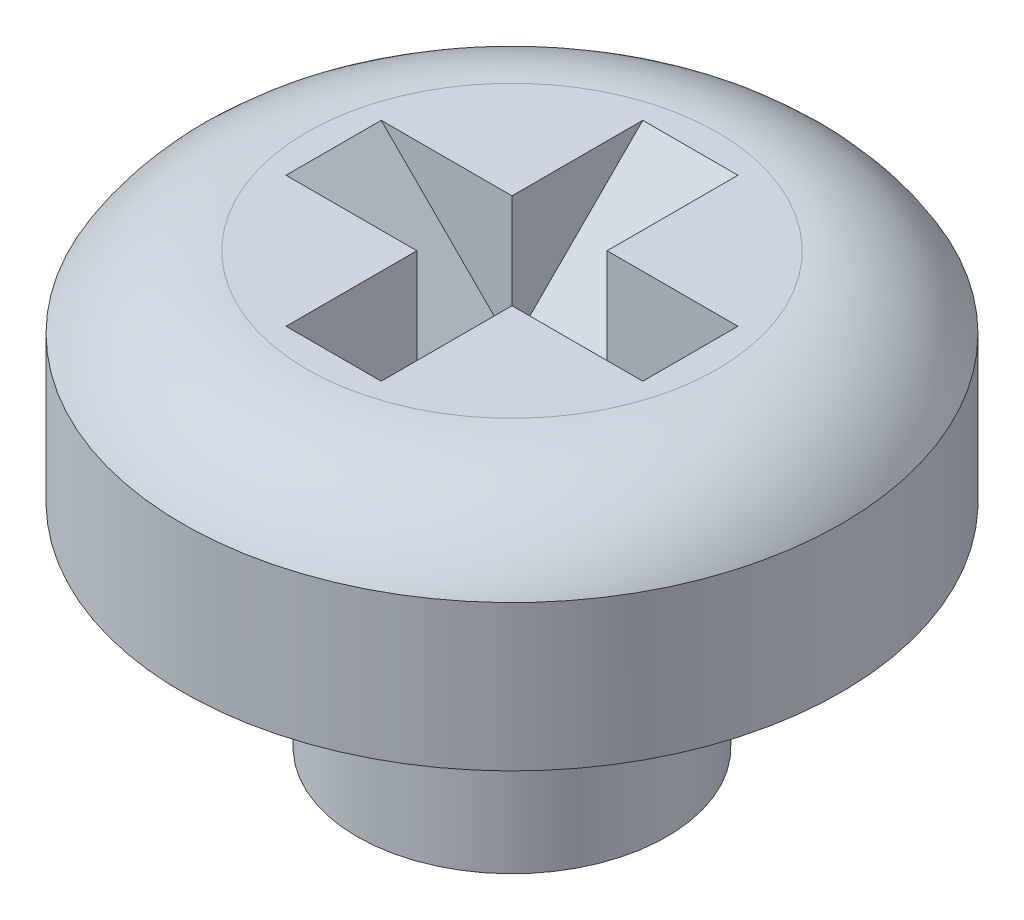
ISO-10303-21;
HEADER;
FILE_DESCRIPTION(('STEP AP214'),'2;1');
FILE_NAME('part.step','',(''),(''),'','','');
FILE_SCHEMA(('AUTOMOTIVE_DESIGN { 1 0 10303 214 1 1 1 1 }'));
ENDSEC;
DATA;
#1=APPLICATION_CONTEXT('core data for automotive mechanical design processes');
#2=APPLICATION_PROTOCOL_DEFINITION('international standard','automotive_design',2000,#1);
#3=PRODUCT_CONTEXT('',#1,'mechanical');
#4=PRODUCT('Part','Part','',(#3));
#5=PRODUCT_RELATED_PRODUCT_CATEGORY('part','',(#4));
#6=PRODUCT_DEFINITION_FORMATION('','',#4);
#7=PRODUCT_DEFINITION_CONTEXT('part definition',#1,'design');
#8=PRODUCT_DEFINITION('design','',#6,#7);
#9=PRODUCT_DEFINITION_SHAPE('','',#8);
#10=(LENGTH_UNIT() NAMED_UNIT(*) SI_UNIT(.MILLI.,.METRE.));
#11=(NAMED_UNIT(*) PLANE_ANGLE_UNIT() SI_UNIT($,.RADIAN.));
#12=(NAMED_UNIT(*) SI_UNIT($,.STERADIAN.) SOLID_ANGLE_UNIT());
#13=UNCERTAINTY_MEASURE_WITH_UNIT(LENGTH_MEASURE(1.E-05),#10,'distance_accuracy_value','');
#14=(GEOMETRIC_REPRESENTATION_CONTEXT(3) GLOBAL_UNCERTAINTY_ASSIGNED_CONTEXT((#13)) GLOBAL_UNIT_ASSIGNED_CONTEXT((#10,
#11,#12)) REPRESENTATION_CONTEXT('',''));
#15=CARTESIAN_POINT('',(0.,0.,0.));
#16=DIRECTION('',(0.,0.,1.));
#17=DIRECTION('',(1.,0.,0.));
#18=AXIS2_PLACEMENT_3D('',#15,#16,#17);
#19=CARTESIAN_POINT('',(0.695421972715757,148.957072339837,-2.77018749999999));
#20=DIRECTION('',(0.,0.707106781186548,0.70710678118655));
#21=DIRECTION('',(0.,-0.707106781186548,0.707106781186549));
#22=AXIS2_PLACEMENT_3D('',#19,#20,#21);
#23=PLANE('',#22);
#24=DIRECTION('',(1.00000000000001,0.,0.));
#25=VECTOR('',#24,1.);
#26=CARTESIAN_POINT('',(0.695421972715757,148.957072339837,-2.77018749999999));
#27=LINE('',#26,#25);
#28=CARTESIAN_POINT('',(1.43413863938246,148.957072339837,-2.77018750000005));
#29=VERTEX_POINT('',#28);
#30=CARTESIAN_POINT('',(-0.0432946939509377,148.957072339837,-2.77018749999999));
#31=VERTEX_POINT('',#30);
#32=EDGE_CURVE('E269',#29,#31,#27,.F.);
#33=ORIENTED_EDGE('',*,*,#32,.T.);
#34=DIRECTION('',(0.,0.707106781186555,-0.707106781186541));
#35=VECTOR('',#34,1.);
#36=CARTESIAN_POINT('',(-0.043294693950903,146.925601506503,-0.738716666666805));
#37=LINE('',#36,#35);
#38=CARTESIAN_POINT('',(-0.0432946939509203,146.925601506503,-0.738716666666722));
#39=VERTEX_POINT('',#38);
#40=EDGE_CURVE('E140',#39,#31,#37,.T.);
#41=ORIENTED_EDGE('',*,*,#40,.F.);
#42=DIRECTION('',(0.577350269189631,-0.577350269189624,0.577350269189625));
#43=VECTOR('',#42,1.);
#44=CARTESIAN_POINT('',(0.695421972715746,146.186884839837,0.));
#45=LINE('',#44,#43);
#46=CARTESIAN_POINT('',(0.695421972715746,146.186884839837,0.));
#47=VERTEX_POINT('',#46);
#48=EDGE_CURVE('E43',#39,#47,#45,.T.);
#49=ORIENTED_EDGE('',*,*,#48,.T.);
#50=DIRECTION('',(-0.577350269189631,-0.577350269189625,0.577350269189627));
#51=VECTOR('',#50,1.);
#52=CARTESIAN_POINT('',(2.54221363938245,148.033676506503,-1.8467916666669));
#53=LINE('',#52,#51);
#54=CARTESIAN_POINT('',(1.43413863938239,146.925601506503,-0.738716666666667));
#55=VERTEX_POINT('',#54);
#56=EDGE_CURVE('E11',#55,#47,#53,.T.);
#57=ORIENTED_EDGE('',*,*,#56,.F.);
#58=DIRECTION('',(0.,-0.707106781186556,0.707106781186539));
#59=VECTOR('',#58,1.);
#60=CARTESIAN_POINT('',(1.43413863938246,148.957072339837,-2.77018750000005));
#61=LINE('',#60,#59);
#62=EDGE_CURVE('E131',#29,#55,#61,.T.);
#63=ORIENTED_EDGE('',*,*,#62,.F.);
#64=EDGE_LOOP('',(#33,#41,#49,#57,#63));
#65=FACE_BOUND('',#64,.T.);
#66=ADVANCED_FACE('F34',(#65),#23,.T.);
#67=CARTESIAN_POINT('',(3.46560947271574,148.957072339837,0.));
#68=DIRECTION('',(-0.707106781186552,0.707106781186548,0.));
#69=DIRECTION('',(-0.707106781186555,-0.707106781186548,0.));
#70=AXIS2_PLACEMENT_3D('',#67,#68,#69);
#71=PLANE('',#70);
#72=DIRECTION('',(0.,0.,1.));
#73=VECTOR('',#72,1.);
#74=CARTESIAN_POINT('',(3.46560947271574,148.957072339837,0.));
#75=LINE('',#74,#73);
#76=CARTESIAN_POINT('',(3.46560947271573,148.957072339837,0.738716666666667));
#77=VERTEX_POINT('',#76);
#78=CARTESIAN_POINT('',(3.46560947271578,148.957072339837,-0.738716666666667));
#79=VERTEX_POINT('',#78);
#80=EDGE_CURVE('E146',#77,#79,#75,.F.);
#81=ORIENTED_EDGE('',*,*,#80,.T.);
#82=DIRECTION('',(0.707106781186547,0.707106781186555,0.));
#83=VECTOR('',#82,1.);
#84=CARTESIAN_POINT('',(1.43413863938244,146.925601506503,-0.738716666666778));
#85=LINE('',#84,#83);
#86=EDGE_CURVE('E143',#55,#79,#85,.T.);
#87=ORIENTED_EDGE('',*,*,#86,.F.);
#88=ORIENTED_EDGE('',*,*,#56,.T.);
#89=DIRECTION('',(-0.577350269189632,-0.577350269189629,-0.577350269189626));
#90=VECTOR('',#89,1.);
#91=CARTESIAN_POINT('',(2.54221363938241,148.033676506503,1.8467916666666));
#92=LINE('',#91,#90);
#93=CARTESIAN_POINT('',(1.4341386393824,146.925601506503,0.738716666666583));
#94=VERTEX_POINT('',#93);
#95=EDGE_CURVE('E250',#94,#47,#92,.T.);
#96=ORIENTED_EDGE('',*,*,#95,.F.);
#97=DIRECTION('',(-0.707106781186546,-0.707106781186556,0.));
#98=VECTOR('',#97,1.);
#99=CARTESIAN_POINT('',(3.46560947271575,148.957072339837,0.738716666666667));
#100=LINE('',#99,#98);
#101=EDGE_CURVE('E149',#77,#94,#100,.T.);
#102=ORIENTED_EDGE('',*,*,#101,.F.);
#103=EDGE_LOOP('',(#81,#87,#88,#96,#102));
#104=FACE_BOUND('',#103,.T.);
#105=ADVANCED_FACE('F144',(#104),#71,.T.);
#106=CARTESIAN_POINT('',(0.695421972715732,146.186884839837,0.));
#107=DIRECTION('',(0.,0.707106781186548,-0.707106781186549));
#108=DIRECTION('',(0.,0.707106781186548,0.707106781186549));
#109=AXIS2_PLACEMENT_3D('',#106,#107,#108);
#110=PLANE('',#109);
#111=DIRECTION('',(1.00000000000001,0.,0.));
#112=VECTOR('',#111,1.);
#113=CARTESIAN_POINT('',(0.695421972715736,148.957072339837,2.77018749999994));
#114=LINE('',#113,#112);
#115=CARTESIAN_POINT('',(-0.0432946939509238,148.957072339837,2.77018749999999));
#116=VERTEX_POINT('',#115);
#117=CARTESIAN_POINT('',(1.43413863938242,148.957072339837,2.77018749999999));
#118=VERTEX_POINT('',#117);
#119=EDGE_CURVE('E278',#116,#118,#114,.T.);
#120=ORIENTED_EDGE('',*,*,#119,.T.);
#121=DIRECTION('',(0.,0.707106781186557,0.707106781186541));
#122=VECTOR('',#121,1.);
#123=CARTESIAN_POINT('',(1.43413863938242,146.925601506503,0.738716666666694));
#124=LINE('',#123,#122);
#125=EDGE_CURVE('E158',#94,#118,#124,.T.);
#126=ORIENTED_EDGE('',*,*,#125,.F.);
#127=ORIENTED_EDGE('',*,*,#95,.T.);
#128=DIRECTION('',(0.57735026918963,-0.577350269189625,-0.577350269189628));
#129=VECTOR('',#128,1.);
#130=CARTESIAN_POINT('',(0.695421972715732,146.186884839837,0.));
#131=LINE('',#130,#129);
#132=CARTESIAN_POINT('',(-0.0432946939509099,146.925601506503,0.738716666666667));
#133=VERTEX_POINT('',#132);
#134=EDGE_CURVE('E123',#133,#47,#131,.T.);
#135=ORIENTED_EDGE('',*,*,#134,.F.);
#136=DIRECTION('',(0.,-0.707106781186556,-0.707106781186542));
#137=VECTOR('',#136,1.);
#138=CARTESIAN_POINT('',(-0.0432946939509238,148.957072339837,2.77018749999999));
#139=LINE('',#138,#137);
#140=EDGE_CURVE('E161',#116,#133,#139,.T.);
#141=ORIENTED_EDGE('',*,*,#140,.F.);
#142=EDGE_LOOP('',(#120,#126,#127,#135,#141));
#143=FACE_BOUND('',#142,.T.);
#144=ADVANCED_FACE('F272',(#143),#110,.T.);
#145=CARTESIAN_POINT('',(0.695421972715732,146.186884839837,0.));
#146=DIRECTION('',(0.707106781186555,0.707106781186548,0.));
#147=DIRECTION('',(-0.707106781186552,0.707106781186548,0.));
#148=AXIS2_PLACEMENT_3D('',#145,#146,#147);
#149=PLANE('',#148);
#150=DIRECTION('',(0.,0.,1.));
#151=VECTOR('',#150,1.);
#152=CARTESIAN_POINT('',(-2.07476552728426,148.957072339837,0.));
#153=LINE('',#152,#151);
#154=CARTESIAN_POINT('',(-2.07476552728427,148.957072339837,-0.738716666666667));
#155=VERTEX_POINT('',#154);
#156=CARTESIAN_POINT('',(-2.07476552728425,148.957072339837,0.738716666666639));
#157=VERTEX_POINT('',#156);
#158=EDGE_CURVE('E74',#155,#157,#153,.T.);
#159=ORIENTED_EDGE('',*,*,#158,.T.);
#160=DIRECTION('',(-0.707106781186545,0.707106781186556,0.));
#161=VECTOR('',#160,1.);
#162=CARTESIAN_POINT('',(-0.0432946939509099,146.925601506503,0.738716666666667));
#163=LINE('',#162,#161);
#164=EDGE_CURVE('E166',#133,#157,#163,.T.);
#165=ORIENTED_EDGE('',*,*,#164,.F.);
#166=ORIENTED_EDGE('',*,*,#134,.T.);
#167=ORIENTED_EDGE('',*,*,#48,.F.);
#168=DIRECTION('',(0.707106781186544,-0.707106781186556,0.));
#169=VECTOR('',#168,1.);
#170=CARTESIAN_POINT('',(-2.07476552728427,148.957072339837,-0.738716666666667));
#171=LINE('',#170,#169);
#172=EDGE_CURVE('E172',#155,#39,#171,.T.);
#173=ORIENTED_EDGE('',*,*,#172,.F.);
#174=EDGE_LOOP('',(#159,#165,#166,#167,#173));
#175=FACE_BOUND('',#174,.T.);
#176=ADVANCED_FACE('F288',(#175),#149,.T.);
#177=CARTESIAN_POINT('',(-0.0432946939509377,146.186884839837,0.));
#178=DIRECTION('',(1.00000000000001,0.,0.));
#179=DIRECTION('',(0.,0.,-1.));
#180=AXIS2_PLACEMENT_3D('',#177,#178,#179);
#181=PLANE('',#180);
#182=ORIENTED_EDGE('',*,*,#40,.T.);
#183=DIRECTION('',(0.,0.,1.));
#184=VECTOR('',#183,1.);
#185=CARTESIAN_POINT('',(-0.0432946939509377,148.957072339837,0.));
#186=LINE('',#185,#184);
#187=CARTESIAN_POINT('',(-0.043294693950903,148.957072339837,-0.738716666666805));
#188=VERTEX_POINT('',#187);
#189=EDGE_CURVE('E110',#188,#31,#186,.F.);
#190=ORIENTED_EDGE('',*,*,#189,.F.);
#191=DIRECTION('',(0.,1.,0.));
#192=VECTOR('',#191,1.);
#193=CARTESIAN_POINT('',(-0.043294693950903,146.186884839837,-0.738716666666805));
#194=LINE('',#193,#192);
#195=EDGE_CURVE('E169',#39,#188,#194,.T.);
#196=ORIENTED_EDGE('',*,*,#195,.F.);
#197=EDGE_LOOP('',(#182,#190,#196));
#198=FACE_BOUND('',#197,.T.);
#199=ADVANCED_FACE('F284',(#198),#181,.T.);
#200=CARTESIAN_POINT('',(1.43413863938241,148.957072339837,2.77018750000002));
#201=DIRECTION('',(-1.00000000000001,0.,0.));
#202=DIRECTION('',(0.,0.,1.));
#203=AXIS2_PLACEMENT_3D('',#200,#201,#202);
#204=PLANE('',#203);
#205=DIRECTION('',(0.,0.,1.));
#206=VECTOR('',#205,1.);
#207=CARTESIAN_POINT('',(1.4341386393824,148.957072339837,0.));
#208=LINE('',#207,#206);
#209=CARTESIAN_POINT('',(1.43413863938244,148.957072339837,-0.738716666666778));
#210=VERTEX_POINT('',#209);
#211=EDGE_CURVE('E139',#29,#210,#208,.T.);
#212=ORIENTED_EDGE('',*,*,#211,.F.);
#213=ORIENTED_EDGE('',*,*,#62,.T.);
#214=DIRECTION('',(0.,1.,0.));
#215=VECTOR('',#214,1.);
#216=CARTESIAN_POINT('',(1.43413863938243,146.186884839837,-0.738716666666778));
#217=LINE('',#216,#215);
#218=EDGE_CURVE('E136',#210,#55,#217,.F.);
#219=ORIENTED_EDGE('',*,*,#218,.F.);
#220=EDGE_LOOP('',(#212,#213,#219));
#221=FACE_BOUND('',#220,.T.);
#222=ADVANCED_FACE('F134',(#221),#204,.T.);
#223=CARTESIAN_POINT('',(0.695421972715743,146.186884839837,-0.738716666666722));
#224=DIRECTION('',(0.,0.,1.));
#225=DIRECTION('',(1.00000000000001,0.,0.));
#226=AXIS2_PLACEMENT_3D('',#223,#224,#225);
#227=PLANE('',#226);
#228=ORIENTED_EDGE('',*,*,#86,.T.);
#229=DIRECTION('',(1.00000000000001,0.,0.));
#230=VECTOR('',#229,1.);
#231=CARTESIAN_POINT('',(4.36159618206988,148.957072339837,-0.738716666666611));
#232=LINE('',#231,#230);
#233=EDGE_CURVE('E152',#210,#79,#232,.T.);
#234=ORIENTED_EDGE('',*,*,#233,.F.);
#235=ORIENTED_EDGE('',*,*,#218,.T.);
#236=EDGE_LOOP('',(#228,#234,#235));
#237=FACE_BOUND('',#236,.T.);
#238=ADVANCED_FACE('F151',(#237),#227,.T.);
#239=CARTESIAN_POINT('',(-2.07476552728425,148.957072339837,0.738716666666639));
#240=DIRECTION('',(0.,0.,-1.));
#241=DIRECTION('',(-1.00000000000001,0.,0.));
#242=AXIS2_PLACEMENT_3D('',#239,#240,#241);
#243=PLANE('',#242);
#244=DIRECTION('',(1.00000000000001,0.,0.));
#245=VECTOR('',#244,1.);
#246=CARTESIAN_POINT('',(4.36159618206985,148.957072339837,0.738716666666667));
#247=LINE('',#246,#245);
#248=CARTESIAN_POINT('',(1.4341386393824,148.957072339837,0.738716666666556));
#249=VERTEX_POINT('',#248);
#250=EDGE_CURVE('E186',#77,#249,#247,.F.);
#251=ORIENTED_EDGE('',*,*,#250,.F.);
#252=ORIENTED_EDGE('',*,*,#101,.T.);
#253=DIRECTION('',(0.,1.,0.));
#254=VECTOR('',#253,1.);
#255=CARTESIAN_POINT('',(1.43413863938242,148.957072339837,0.738716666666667));
#256=LINE('',#255,#254);
#257=EDGE_CURVE('E157',#249,#94,#256,.F.);
#258=ORIENTED_EDGE('',*,*,#257,.F.);
#259=EDGE_LOOP('',(#251,#252,#258));
#260=FACE_BOUND('',#259,.T.);
#261=ADVANCED_FACE('F275',(#260),#243,.T.);
#262=CARTESIAN_POINT('',(1.43413863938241,148.957072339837,2.77018750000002));
#263=DIRECTION('',(-1.00000000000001,0.,0.));
#264=DIRECTION('',(0.,0.,1.));
#265=AXIS2_PLACEMENT_3D('',#262,#263,#264);
#266=PLANE('',#265);
#267=ORIENTED_EDGE('',*,*,#125,.T.);
#268=DIRECTION('',(0.,0.,1.));
#269=VECTOR('',#268,1.);
#270=CARTESIAN_POINT('',(1.43413863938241,148.957072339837,0.));
#271=LINE('',#270,#269);
#272=EDGE_CURVE('E183',#249,#118,#271,.T.);
#273=ORIENTED_EDGE('',*,*,#272,.F.);
#274=ORIENTED_EDGE('',*,*,#257,.T.);
#275=EDGE_LOOP('',(#267,#273,#274));
#276=FACE_BOUND('',#275,.T.);
#277=ADVANCED_FACE('F297',(#276),#266,.T.);
#278=CARTESIAN_POINT('',(-0.0432946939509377,146.186884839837,0.));
#279=DIRECTION('',(1.00000000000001,0.,0.));
#280=DIRECTION('',(0.,0.,-1.));
#281=AXIS2_PLACEMENT_3D('',#278,#279,#280);
#282=PLANE('',#281);
#283=DIRECTION('',(0.,0.,1.));
#284=VECTOR('',#283,1.);
#285=CARTESIAN_POINT('',(-0.0432946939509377,148.957072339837,0.));
#286=LINE('',#285,#284);
#287=CARTESIAN_POINT('',(-0.0432946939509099,148.957072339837,0.738716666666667));
#288=VERTEX_POINT('',#287);
#289=EDGE_CURVE('E180',#116,#288,#286,.F.);
#290=ORIENTED_EDGE('',*,*,#289,.F.);
#291=ORIENTED_EDGE('',*,*,#140,.T.);
#292=DIRECTION('',(0.,1.,0.));
#293=VECTOR('',#292,1.);
#294=CARTESIAN_POINT('',(-0.0432946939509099,148.957072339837,0.738716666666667));
#295=LINE('',#294,#293);
#296=EDGE_CURVE('E165',#288,#133,#295,.F.);
#297=ORIENTED_EDGE('',*,*,#296,.F.);
#298=EDGE_LOOP('',(#290,#291,#297));
#299=FACE_BOUND('',#298,.T.);
#300=ADVANCED_FACE('F295',(#299),#282,.T.);
#301=CARTESIAN_POINT('',(-2.07476552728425,148.957072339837,0.738716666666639));
#302=DIRECTION('',(0.,0.,-1.));
#303=DIRECTION('',(-1.00000000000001,0.,0.));
#304=AXIS2_PLACEMENT_3D('',#301,#302,#303);
#305=PLANE('',#304);
#306=ORIENTED_EDGE('',*,*,#164,.T.);
#307=DIRECTION('',(1.00000000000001,0.,0.));
#308=VECTOR('',#307,1.);
#309=CARTESIAN_POINT('',(4.36159618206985,148.957072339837,0.738716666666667));
#310=LINE('',#309,#308);
#311=EDGE_CURVE('E178',#288,#157,#310,.F.);
#312=ORIENTED_EDGE('',*,*,#311,.F.);
#313=ORIENTED_EDGE('',*,*,#296,.T.);
#314=EDGE_LOOP('',(#306,#312,#313));
#315=FACE_BOUND('',#314,.T.);
#316=ADVANCED_FACE('F292',(#315),#305,.T.);
#317=CARTESIAN_POINT('',(0.695421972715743,146.186884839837,-0.738716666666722));
#318=DIRECTION('',(0.,0.,1.));
#319=DIRECTION('',(1.00000000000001,0.,0.));
#320=AXIS2_PLACEMENT_3D('',#317,#318,#319);
#321=PLANE('',#320);
#322=DIRECTION('',(1.00000000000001,0.,0.));
#323=VECTOR('',#322,1.);
#324=CARTESIAN_POINT('',(4.36159618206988,148.957072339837,-0.738716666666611));
#325=LINE('',#324,#323);
#326=EDGE_CURVE('E176',#155,#188,#325,.T.);
#327=ORIENTED_EDGE('',*,*,#326,.F.);
#328=ORIENTED_EDGE('',*,*,#172,.T.);
#329=ORIENTED_EDGE('',*,*,#195,.T.);
#330=EDGE_LOOP('',(#327,#328,#329));
#331=FACE_BOUND('',#330,.T.);
#332=ADVANCED_FACE('F287',(#331),#321,.T.);
#333=CARTESIAN_POINT('',(4.36159618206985,148.957072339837,0.));
#334=DIRECTION('',(0.,1.,0.));
#335=DIRECTION('',(0.,0.,1.));
#336=AXIS2_PLACEMENT_3D('',#333,#334,#335);
#337=PLANE('',#336);
#338=ORIENTED_EDGE('',*,*,#158,.F.);
#339=ORIENTED_EDGE('',*,*,#326,.T.);
#340=ORIENTED_EDGE('',*,*,#189,.T.);
#341=ORIENTED_EDGE('',*,*,#32,.F.);
#342=ORIENTED_EDGE('',*,*,#211,.T.);
#343=ORIENTED_EDGE('',*,*,#233,.T.);
#344=ORIENTED_EDGE('',*,*,#80,.F.);
#345=ORIENTED_EDGE('',*,*,#250,.T.);
#346=ORIENTED_EDGE('',*,*,#272,.T.);
#347=ORIENTED_EDGE('',*,*,#119,.F.);
#348=ORIENTED_EDGE('',*,*,#289,.T.);
#349=ORIENTED_EDGE('',*,*,#311,.T.);
#350=EDGE_LOOP('',(#338,#339,#340,#341,#342,#343,#344,#345,#346,#347,#348,#349));
#351=FACE_BOUND('',#350,.T.);
#352=CARTESIAN_POINT('',(0.695421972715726,148.957072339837,0.));
#353=DIRECTION('',(0.,-1.,0.));
#354=DIRECTION('',(0.,0.,-1.));
#355=AXIS2_PLACEMENT_3D('',#352,#353,#354);
#356=CIRCLE('',#355,3.18757919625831);
#357=CARTESIAN_POINT('',(0.695421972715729,148.957072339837,3.18757919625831));
#358=VERTEX_POINT('',#357);
#359=CARTESIAN_POINT('',(0.695421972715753,148.957072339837,-3.18757919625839));
#360=VERTEX_POINT('',#359);
#361=EDGE_CURVE('E66',#358,#360,#356,.T.);
#362=ORIENTED_EDGE('',*,*,#361,.F.);
#363=CARTESIAN_POINT('',(3.88300116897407,148.957072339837,0.));
#364=CARTESIAN_POINT('',(3.88299589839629,148.957072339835,0.0333513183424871));
#365=CARTESIAN_POINT('',(3.88246751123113,148.957072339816,0.0667025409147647));
#366=CARTESIAN_POINT('',(3.88036583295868,148.957072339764,0.133371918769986));
#367=CARTESIAN_POINT('',(3.87879254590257,148.957072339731,0.166690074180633));
#368=CARTESIAN_POINT('',(3.87460240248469,148.95707233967,0.233260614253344));
#369=CARTESIAN_POINT('',(3.87198554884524,148.957072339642,0.266512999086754));
#370=CARTESIAN_POINT('',(3.86571090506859,148.957072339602,0.332919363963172));
#371=CARTESIAN_POINT('',(3.86205311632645,148.957072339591,0.366073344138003));
#372=CARTESIAN_POINT('',(3.85370017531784,148.957072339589,0.432250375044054));
#373=CARTESIAN_POINT('',(3.84900502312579,148.957072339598,0.465273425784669));
#374=CARTESIAN_POINT('',(3.83858198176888,148.957072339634,0.531156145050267));
#375=CARTESIAN_POINT('',(3.83285409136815,148.957072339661,0.564015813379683));
#376=CARTESIAN_POINT('',(3.82037113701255,148.957072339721,0.629539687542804));
#377=CARTESIAN_POINT('',(3.8136160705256,148.957072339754,0.662203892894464));
#378=CARTESIAN_POINT('',(3.79908559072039,148.957072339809,0.727304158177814));
#379=CARTESIAN_POINT('',(3.79131017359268,148.957072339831,0.759740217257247));
#380=CARTESIAN_POINT('',(3.77072367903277,148.957072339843,0.840044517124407));
#381=CARTESIAN_POINT('',(3.7573009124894,148.957072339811,0.887757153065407));
#382=CARTESIAN_POINT('',(3.72824804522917,148.957072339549,0.982507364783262));
#383=CARTESIAN_POINT('',(3.71261792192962,148.957072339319,1.02954493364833));
#384=CARTESIAN_POINT('',(3.68964850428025,148.957072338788,1.09364045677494));
#385=CARTESIAN_POINT('',(3.68324257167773,148.957072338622,1.11103698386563));
#386=CARTESIAN_POINT('',(3.6701279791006,148.957072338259,1.14571579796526));
#387=CARTESIAN_POINT('',(3.66341931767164,148.957072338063,1.16299808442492));
#388=CARTESIAN_POINT('',(3.64322352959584,148.957072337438,1.21370860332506));
#389=CARTESIAN_POINT('',(3.62931815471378,148.957072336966,1.24697132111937));
#390=CARTESIAN_POINT('',(3.6003870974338,148.957072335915,1.31300549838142));
#391=CARTESIAN_POINT('',(3.58536140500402,148.957072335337,1.34577695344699));
#392=CARTESIAN_POINT('',(3.55420669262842,148.957072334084,1.41079171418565));
#393=CARTESIAN_POINT('',(3.53807766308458,148.957072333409,1.44303501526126));
#394=CARTESIAN_POINT('',(3.50473491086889,148.957072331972,1.50695610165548));
#395=CARTESIAN_POINT('',(3.48752117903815,148.95707233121,1.53863388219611));
#396=CARTESIAN_POINT('',(3.45202880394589,148.95707232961,1.60138750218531));
#397=CARTESIAN_POINT('',(3.43375015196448,148.957072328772,1.63246333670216));
#398=CARTESIAN_POINT('',(3.39614897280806,148.957072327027,1.69397725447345));
#399=CARTESIAN_POINT('',(3.376826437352,148.957072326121,1.72441533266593));
#400=CARTESIAN_POINT('',(3.33715972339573,148.957072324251,1.78461868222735));
#401=CARTESIAN_POINT('',(3.31681553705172,148.957072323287,1.81438394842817));
#402=CARTESIAN_POINT('',(3.27512893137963,148.957072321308,1.87320738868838));
#403=CARTESIAN_POINT('',(3.25378650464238,148.957072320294,1.90226555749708));
#404=CARTESIAN_POINT('',(3.21012798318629,148.957072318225,1.95964132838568));
#405=CARTESIAN_POINT('',(3.18781188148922,148.95707231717,1.98795892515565));
#406=CARTESIAN_POINT('',(3.14223167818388,148.957072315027,2.04382094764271));
#407=CARTESIAN_POINT('',(3.1189675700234,148.957072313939,2.07136536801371));
#408=CARTESIAN_POINT('',(3.07151818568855,148.957072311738,2.12564925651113));
#409=CARTESIAN_POINT('',(3.0473329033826,148.957072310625,2.15238871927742));
#410=CARTESIAN_POINT('',(2.99806879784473,148.957072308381,2.20503208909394));
#411=CARTESIAN_POINT('',(2.97298996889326,148.95707230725,2.23093599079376));
#412=CARTESIAN_POINT('',(2.92561255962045,148.957072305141,2.2782392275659));
#413=CARTESIAN_POINT('',(2.90342854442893,148.957072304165,2.29975346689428));
#414=CARTESIAN_POINT('',(2.85844404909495,148.957072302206,2.34212795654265));
#415=CARTESIAN_POINT('',(2.83564356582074,148.957072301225,2.36298820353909));
#416=CARTESIAN_POINT('',(2.78944546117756,148.957072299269,2.40403692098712));
#417=CARTESIAN_POINT('',(2.76604783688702,148.957072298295,2.42422538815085));
#418=CARTESIAN_POINT('',(2.71867558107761,148.957072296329,2.46391341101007));
#419=CARTESIAN_POINT('',(2.69470094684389,148.957072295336,2.4834129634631));
#420=CARTESIAN_POINT('',(2.63948803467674,148.957072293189,2.52700061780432));
#421=CARTESIAN_POINT('',(2.6080741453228,148.957072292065,2.55086680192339));
#422=CARTESIAN_POINT('',(2.54438153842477,148.957072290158,2.59741537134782));
#423=CARTESIAN_POINT('',(2.51210281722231,148.957072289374,2.62009775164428));
#424=CARTESIAN_POINT('',(2.44672490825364,148.957072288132,2.66424783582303));
#425=CARTESIAN_POINT('',(2.4136257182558,148.957072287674,2.68571553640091));
#426=CARTESIAN_POINT('',(2.34665240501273,148.957072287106,2.72740659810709));
#427=CARTESIAN_POINT('',(2.31277828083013,148.957072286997,2.74762995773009));
#428=CARTESIAN_POINT('',(2.24858229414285,148.95707228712,2.78435570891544));
#429=CARTESIAN_POINT('',(2.21834562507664,148.957072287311,2.80100724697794));
#430=CARTESIAN_POINT('',(2.15734682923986,148.957072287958,2.83331866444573));
#431=CARTESIAN_POINT('',(2.1265847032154,148.957072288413,2.84897854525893));
#432=CARTESIAN_POINT('',(2.06456776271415,148.957072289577,2.87928994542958));
#433=CARTESIAN_POINT('',(2.03331294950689,148.957072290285,2.89394146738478));
#434=CARTESIAN_POINT('',(1.9703436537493,148.957072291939,2.92222068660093));
#435=CARTESIAN_POINT('',(1.93862917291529,148.957072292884,2.93584838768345));
#436=CARTESIAN_POINT('',(1.87477412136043,148.957072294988,2.96206554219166));
#437=CARTESIAN_POINT('',(1.84263355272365,148.957072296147,2.97465500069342));
#438=CARTESIAN_POINT('',(1.77796033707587,148.957072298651,2.99878236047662));
#439=CARTESIAN_POINT('',(1.74542769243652,148.957072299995,3.01032026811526));
#440=CARTESIAN_POINT('',(1.68000475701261,148.957072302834,3.03233232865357));
#441=CARTESIAN_POINT('',(1.64711446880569,148.957072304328,3.04280648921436));
#442=CARTESIAN_POINT('',(1.58101105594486,148.957072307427,3.06267998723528));
#443=CARTESIAN_POINT('',(1.54779793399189,148.95707230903,3.07207933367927));
#444=CARTESIAN_POINT('',(1.48108400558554,148.9570723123,3.08979327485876));
#445=CARTESIAN_POINT('',(1.4475832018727,148.957072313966,3.09810787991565));
#446=CARTESIAN_POINT('',(1.38032936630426,148.957072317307,3.11364356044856));
#447=CARTESIAN_POINT('',(1.34657633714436,148.957072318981,3.12086464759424));
#448=CARTESIAN_POINT('',(1.27885377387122,148.95707232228,3.13420567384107));
#449=CARTESIAN_POINT('',(1.24488424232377,148.957072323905,3.14032562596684));
#450=CARTESIAN_POINT('',(1.17676462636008,148.957072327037,3.151457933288));
#451=CARTESIAN_POINT('',(1.1426145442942,148.957072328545,3.15647030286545));
#452=CARTESIAN_POINT('',(1.07416996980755,148.957072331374,3.165382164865));
#453=CARTESIAN_POINT('',(1.03987547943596,148.957072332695,3.16928167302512));
#454=CARTESIAN_POINT('',(0.971178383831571,148.957072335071,3.1759637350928));
#455=CARTESIAN_POINT('',(0.936775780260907,148.957072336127,3.17874630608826));
#456=CARTESIAN_POINT('',(0.867898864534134,148.957072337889,3.18319151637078));
#457=CARTESIAN_POINT('',(0.833424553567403,148.957072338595,3.18485417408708));
#458=CARTESIAN_POINT('',(0.764440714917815,148.957072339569,3.18705808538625));
#459=CARTESIAN_POINT('',(0.729931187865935,148.957072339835,3.18759935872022));
#460=CARTESIAN_POINT('',(0.695421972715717,148.957072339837,3.18757919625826));
#461=B_SPLINE_CURVE_WITH_KNOTS('',3,(#363,#364,#365,#366,#367,#368,#369,#370,#371,#372,#373,
#374,#375,#376,#377,#378,#379,#380,#381,#382,#383,#384,#385,#386,#387,#388,#389,#390,#391,#392,
#393,#394,#395,#396,#397,#398,#399,#400,#401,#402,#403,#404,#405,#406,#407,#408,#409,#410,#411,
#412,#413,#414,#415,#416,#417,#418,#419,#420,#421,#422,#423,#424,#425,#426,#427,#428,#429,#430,
#431,#432,#433,#434,#435,#436,#437,#438,#439,#440,#441,#442,#443,#444,#445,#446,#447,#448,#449,
#450,#451,#452,#453,#454,#455,#456,#457,#458,#459,#460),.UNSPECIFIED.,.F.,.F.,(4,2,2,2,2,2,2,2,
2,2,2,2,2,2,2,2,2,2,2,2,2,2,2,2,2,2,2,2,2,2,2,2,2,2,2,2,2,2,2,2,2,2,2,2,2,2,2,2,4),(0.,
0.10004984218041,0.200099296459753,0.300148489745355,0.400197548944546,0.500246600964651,
0.600295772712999,0.700345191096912,0.80039498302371,0.949034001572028,1.09767454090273,
1.15328784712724,1.20890142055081,1.31703585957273,1.42517126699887,1.53330761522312,
1.64144487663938,1.74958302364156,1.85772202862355,1.96586186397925,2.07400250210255,
2.18214391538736,2.29028607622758,2.3984289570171,2.50657253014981,2.59926873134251,
2.69196540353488,2.78466252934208,2.8773600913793,2.99568653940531,3.11401348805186,
3.23234075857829,3.35066817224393,3.45420603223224,3.55774374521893,3.6612811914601,
3.76481825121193,3.86835480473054,3.9718907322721,4.07542591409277,4.17896023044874,
4.2824935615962,4.38602578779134,4.48955678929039,4.59308644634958,4.69661463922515,
4.80014124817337,4.90366615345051,5.00718923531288),.UNSPECIFIED.);
#462=CARTESIAN_POINT('',(3.88300116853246,148.957072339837,2.69296226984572E-06));
#463=VERTEX_POINT('',#462);
#464=EDGE_CURVE('E57',#463,#358,#461,.T.);
#465=ORIENTED_EDGE('',*,*,#464,.F.);
#466=CARTESIAN_POINT('',(0.695421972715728,148.957072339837,-3.18757919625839));
#467=CARTESIAN_POINT('',(0.728773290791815,148.957072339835,-3.18757390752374));
#468=CARTESIAN_POINT('',(0.762124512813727,148.957072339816,-3.18704550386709));
#469=CARTESIAN_POINT('',(0.828793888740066,148.957072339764,-3.18494379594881));
#470=CARTESIAN_POINT('',(0.862112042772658,148.95707233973,-3.183370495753));
#471=CARTESIAN_POINT('',(0.928682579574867,148.957072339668,-3.17918032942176));
#472=CARTESIAN_POINT('',(0.961934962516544,148.95707233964,-3.17656346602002));
#473=CARTESIAN_POINT('',(1.02834132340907,148.957072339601,-3.17028880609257));
#474=CARTESIAN_POINT('',(1.06149530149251,148.957072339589,-3.16663101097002));
#475=CARTESIAN_POINT('',(1.12767232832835,148.957072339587,-3.15827806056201));
#476=CARTESIAN_POINT('',(1.16069537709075,148.957072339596,-3.15358290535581));
#477=CARTESIAN_POINT('',(1.22657809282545,148.957072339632,-3.14315986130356));
#478=CARTESIAN_POINT('',(1.25943775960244,148.957072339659,-3.13743197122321));
#479=CARTESIAN_POINT('',(1.32496163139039,148.957072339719,-3.12494902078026));
#480=CARTESIAN_POINT('',(1.357625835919,148.957072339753,-3.11819395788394));
#481=CARTESIAN_POINT('',(1.42272610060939,148.957072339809,-3.10366348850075));
#482=CARTESIAN_POINT('',(1.45516215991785,148.957072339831,-3.09588807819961));
#483=CARTESIAN_POINT('',(1.53546646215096,148.957072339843,-3.07530160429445));
#484=CARTESIAN_POINT('',(1.5831791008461,148.957072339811,-3.0618788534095));
#485=CARTESIAN_POINT('',(1.67792932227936,148.95707233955,-3.03282602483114));
#486=CARTESIAN_POINT('',(1.72496689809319,148.95707233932,-3.0171959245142));
#487=CARTESIAN_POINT('',(1.78906243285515,148.957072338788,-2.99422654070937));
#488=CARTESIAN_POINT('',(1.8064589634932,148.957072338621,-2.98782061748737));
#489=CARTESIAN_POINT('',(1.8411377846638,148.957072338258,-2.97470604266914));
#490=CARTESIAN_POINT('',(1.85842007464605,148.957072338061,-2.96799738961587));
#491=CARTESIAN_POINT('',(1.90913060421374,148.957072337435,-2.94780162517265));
#492=CARTESIAN_POINT('',(1.94239332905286,148.957072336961,-2.9338962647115));
#493=CARTESIAN_POINT('',(2.00842752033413,148.957072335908,-2.90496523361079));
#494=CARTESIAN_POINT('',(2.04119898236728,148.957072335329,-2.88993955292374));
#495=CARTESIAN_POINT('',(2.10621375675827,148.957072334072,-2.85878486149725));
#496=CARTESIAN_POINT('',(2.13845706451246,148.957072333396,-2.84265584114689));
#497=CARTESIAN_POINT('',(2.20237816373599,148.957072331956,-2.80931310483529));
#498=CARTESIAN_POINT('',(2.23405595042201,148.957072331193,-2.7920993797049));
#499=CARTESIAN_POINT('',(2.29680958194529,148.95707232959,-2.75660701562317));
#500=CARTESIAN_POINT('',(2.32788542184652,148.95707232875,-2.73832836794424));
#501=CARTESIAN_POINT('',(2.38939934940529,148.957072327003,-2.70072719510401));
#502=CARTESIAN_POINT('',(2.41983743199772,148.957072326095,-2.68140466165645));
#503=CARTESIAN_POINT('',(2.48004078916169,148.957072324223,-2.64173794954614));
#504=CARTESIAN_POINT('',(2.50980605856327,148.957072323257,-2.6213937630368));
#505=CARTESIAN_POINT('',(2.56862950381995,148.957072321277,-2.57970715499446));
#506=CARTESIAN_POINT('',(2.59768767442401,148.957072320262,-2.55836472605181));
#507=CARTESIAN_POINT('',(2.65506344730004,148.957072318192,-2.51470619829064));
#508=CARTESIAN_POINT('',(2.68338104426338,148.957072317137,-2.49239009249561));
#509=CARTESIAN_POINT('',(2.73924306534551,148.957072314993,-2.44680987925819));
#510=CARTESIAN_POINT('',(2.76678748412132,148.957072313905,-2.42354576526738));
#511=CARTESIAN_POINT('',(2.82107136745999,148.957072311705,-2.37609636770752));
#512=CARTESIAN_POINT('',(2.84781082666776,148.957072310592,-2.35191107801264));
#513=CARTESIAN_POINT('',(2.90045418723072,148.95707230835,-2.30264695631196));
#514=CARTESIAN_POINT('',(2.92635808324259,148.957072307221,-2.27756811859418));
#515=CARTESIAN_POINT('',(2.97366130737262,148.957072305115,-2.2301906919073));
#516=CARTESIAN_POINT('',(2.99517554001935,148.95707230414,-2.2080066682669));
#517=CARTESIAN_POINT('',(3.03755001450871,148.957072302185,-2.16302215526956));
#518=CARTESIAN_POINT('',(3.05841025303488,148.957072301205,-2.14022166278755));
#519=CARTESIAN_POINT('',(3.09945895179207,148.957072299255,-2.09402353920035));
#520=CARTESIAN_POINT('',(3.11964740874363,148.957072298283,-2.07062590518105));
#521=CARTESIAN_POINT('',(3.15933540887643,148.957072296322,-2.02325362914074));
#522=CARTESIAN_POINT('',(3.17883494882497,148.957072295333,-1.99927898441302));
#523=CARTESIAN_POINT('',(3.22242257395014,148.957072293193,-1.94406604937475));
#524=CARTESIAN_POINT('',(3.24628874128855,148.957072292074,-1.91265214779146));
#525=CARTESIAN_POINT('',(3.29283727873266,148.957072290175,-1.8489595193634));
#526=CARTESIAN_POINT('',(3.31551964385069,148.957072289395,-1.81668078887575));
#527=CARTESIAN_POINT('',(3.3596696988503,148.95707228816,-1.75130286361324));
#528=CARTESIAN_POINT('',(3.38113738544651,148.957072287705,-1.71820366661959));
#529=CARTESIAN_POINT('',(3.42282842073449,148.957072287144,-1.65123034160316));
#530=CARTESIAN_POINT('',(3.44305176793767,148.957072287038,-1.61735621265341));
#531=CARTESIAN_POINT('',(3.47977749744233,148.957072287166,-1.55316021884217));
#532=CARTESIAN_POINT('',(3.49642902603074,148.957072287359,-1.52292354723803));
#533=CARTESIAN_POINT('',(3.52874042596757,148.957072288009,-1.46192474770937));
#534=CARTESIAN_POINT('',(3.54440029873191,148.957072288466,-1.43116262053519));
#535=CARTESIAN_POINT('',(3.57471168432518,148.957072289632,-1.36914567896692));
#536=CARTESIAN_POINT('',(3.58936319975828,148.957072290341,-1.33789086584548));
#537=CARTESIAN_POINT('',(3.61764240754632,148.957072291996,-1.27492157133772));
#538=CARTESIAN_POINT('',(3.63127010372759,148.957072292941,-1.24320709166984));
#539=CARTESIAN_POINT('',(3.65748725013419,148.957072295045,-1.17935204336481));
#540=CARTESIAN_POINT('',(3.67007670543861,148.957072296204,-1.14721147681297));
#541=CARTESIAN_POINT('',(3.69420406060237,148.957072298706,-1.08253826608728));
#542=CARTESIAN_POINT('',(3.70574196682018,148.95707230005,-1.05000562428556));
#543=CARTESIAN_POINT('',(3.72775402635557,148.957072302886,-0.984582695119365));
#544=CARTESIAN_POINT('',(3.73822818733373,148.95707230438,-0.951692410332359));
#545=CARTESIAN_POINT('',(3.75810168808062,148.957072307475,-0.885589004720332));
#546=CARTESIAN_POINT('',(3.7675010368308,148.957072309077,-0.852375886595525));
#547=CARTESIAN_POINT('',(3.78521498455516,148.957072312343,-0.785661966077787));
#548=CARTESIAN_POINT('',(3.79352959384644,148.957072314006,-0.752161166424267));
#549=CARTESIAN_POINT('',(3.80906528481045,148.957072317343,-0.684907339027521));
#550=CARTESIAN_POINT('',(3.81628637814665,148.957072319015,-0.651154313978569));
#551=CARTESIAN_POINT('',(3.82962741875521,148.957072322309,-0.583431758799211));
#552=CARTESIAN_POINT('',(3.83574737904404,148.957072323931,-0.549462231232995));
#553=CARTESIAN_POINT('',(3.84687970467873,148.957072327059,-0.481342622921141));
#554=CARTESIAN_POINT('',(3.85189208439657,148.957072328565,-0.447192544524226));
#555=CARTESIAN_POINT('',(3.86080396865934,148.957072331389,-0.378747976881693));
#556=CARTESIAN_POINT('',(3.86470348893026,148.957072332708,-0.34445348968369));
#557=CARTESIAN_POINT('',(3.87138557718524,148.95707233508,-0.275756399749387));
#558=CARTESIAN_POINT('',(3.87416816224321,148.957072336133,-0.24135379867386));
#559=CARTESIAN_POINT('',(3.87861340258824,148.957072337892,-0.172476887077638));
#560=CARTESIAN_POINT('',(3.88027607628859,148.957072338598,-0.1380025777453));
#561=CARTESIAN_POINT('',(3.88248002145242,148.957072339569,-0.0690187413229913));
#562=CARTESIAN_POINT('',(3.88302131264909,148.957072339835,-0.0345092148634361));
#563=CARTESIAN_POINT('',(3.88300116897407,148.957072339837,0.));
#564=B_SPLINE_CURVE_WITH_KNOTS('',3,(#466,#467,#468,#469,#470,#471,#472,#473,#474,#475,#476,
#477,#478,#479,#480,#481,#482,#483,#484,#485,#486,#487,#488,#489,#490,#491,#492,#493,#494,#495,
#496,#497,#498,#499,#500,#501,#502,#503,#504,#505,#506,#507,#508,#509,#510,#511,#512,#513,#514,
#515,#516,#517,#518,#519,#520,#521,#522,#523,#524,#525,#526,#527,#528,#529,#530,#531,#532,#533,
#534,#535,#536,#537,#538,#539,#540,#541,#542,#543,#544,#545,#546,#547,#548,#549,#550,#551,#552,
#553,#554,#555,#556,#557,#558,#559,#560,#561,#562,#563),.UNSPECIFIED.,.F.,.F.,(4,2,2,2,2,2,2,2,
2,2,2,2,2,2,2,2,2,2,2,2,2,2,2,2,2,2,2,2,2,2,2,2,2,2,2,2,2,2,2,2,2,2,2,2,2,2,2,2,4),(0.,
0.100049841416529,0.200099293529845,0.30014848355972,0.400197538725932,0.500246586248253,
0.600295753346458,0.700345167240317,0.800394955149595,0.949033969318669,1.09767450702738,
1.15328781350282,1.2089013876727,1.31703582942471,1.4251712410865,1.5333075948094,
1.64144486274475,1.74958301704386,1.85772202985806,1.96586187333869,2.07400251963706,
2.1821439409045,2.29028610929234,2.3984289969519,2.5065725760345,2.59926878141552,
2.69196545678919,2.78466258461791,2.87736014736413,2.99568659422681,3.1140135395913,
3.23234080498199,3.35066821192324,3.45420606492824,3.55774377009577,3.6612812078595,
3.76481825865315,3.86835480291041,3.971890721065,4.07542589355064,4.17896020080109,
4.28249352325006,4.38602574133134,4.48955673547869,4.59308638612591,4.69661457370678,
4.80014117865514,4.90366608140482,5.00718916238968),.UNSPECIFIED.);
#565=EDGE_CURVE('E232',#360,#463,#564,.T.);
#566=ORIENTED_EDGE('',*,*,#565,.F.);
#567=EDGE_LOOP('',(#362,#465,#566));
#568=FACE_BOUND('',#567,.T.);
#569=ADVANCED_FACE('F277',(#351,#568),#337,.T.);
#570=CARTESIAN_POINT('',(0.695421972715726,146.727361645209,0.));
#571=DIRECTION('',(0.,-1.,0.));
#572=DIRECTION('',(0.,0.,-1.));
#573=AXIS2_PLACEMENT_3D('',#570,#571,#572);
#574=TOROIDAL_SURFACE('',#573,3.18757919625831,2.22971069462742);
#575=CARTESIAN_POINT('',(0.695421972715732,147.843231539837,0.));
#576=DIRECTION('',(0.,-1.,0.));
#577=DIRECTION('',(1.00000000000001,0.,0.));
#578=AXIS2_PLACEMENT_3D('',#575,#576,#577);
#579=CIRCLE('',#578,5.11797919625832);
#580=CARTESIAN_POINT('',(5.8134011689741,147.843231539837,0.));
#581=VERTEX_POINT('',#580);
#582=EDGE_CURVE('E228',#581,#581,#579,.T.);
#583=ORIENTED_EDGE('',*,*,#582,.F.);
#584=EDGE_LOOP('',(#583));
#585=FACE_BOUND('',#584,.T.);
#586=ORIENTED_EDGE('',*,*,#565,.T.);
#587=ORIENTED_EDGE('',*,*,#464,.T.);
#588=ORIENTED_EDGE('',*,*,#361,.T.);
#589=EDGE_LOOP('',(#586,#587,#588));
#590=FACE_BOUND('',#589,.T.);
#591=ADVANCED_FACE('F36',(#585,#590),#574,.T.);
#592=CARTESIAN_POINT('',(0.695421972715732,147.843231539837,0.));
#593=DIRECTION('',(0.,-1.,0.));
#594=DIRECTION('',(0.,0.,-1.));
#595=AXIS2_PLACEMENT_3D('',#592,#593,#594);
#596=CYLINDRICAL_SURFACE('',#595,5.11797919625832);
#597=CARTESIAN_POINT('',(0.695421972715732,145.578872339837,0.));
#598=DIRECTION('',(0.,-1.,0.));
#599=DIRECTION('',(0.,0.,-1.));
#600=AXIS2_PLACEMENT_3D('',#597,#598,#599);
#601=CIRCLE('',#600,5.11797919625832);
#602=CARTESIAN_POINT('',(0.695421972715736,145.578872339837,-5.11797919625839));
#603=VERTEX_POINT('',#602);
#604=EDGE_CURVE('E231',#603,#603,#601,.T.);
#605=ORIENTED_EDGE('',*,*,#604,.F.);
#606=EDGE_LOOP('',(#605));
#607=FACE_BOUND('',#606,.T.);
#608=ORIENTED_EDGE('',*,*,#582,.T.);
#609=EDGE_LOOP('',(#608));
#610=FACE_BOUND('',#609,.T.);
#611=ADVANCED_FACE('F313',(#607,#610),#596,.T.);
#612=CARTESIAN_POINT('',(6.34914618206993,145.578872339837,0.));
#613=DIRECTION('',(0.,-1.,0.));
#614=DIRECTION('',(0.,0.,-1.));
#615=AXIS2_PLACEMENT_3D('',#612,#613,#614);
#616=PLANE('',#615);
#617=CARTESIAN_POINT('',(0.695421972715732,145.578872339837,0.));
#618=DIRECTION('',(0.,1.,0.));
#619=DIRECTION('',(0.,0.,1.));
#620=AXIS2_PLACEMENT_3D('',#617,#618,#619);
#621=CIRCLE('',#620,3.94462);
#622=CARTESIAN_POINT('',(0.69542197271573,145.578872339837,3.94461999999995));
#623=VERTEX_POINT('',#622);
#624=EDGE_CURVE('E260',#623,#623,#621,.F.);
#625=ORIENTED_EDGE('',*,*,#624,.F.);
#626=EDGE_LOOP('',(#625));
#627=FACE_BOUND('',#626,.T.);
#628=ORIENTED_EDGE('',*,*,#604,.T.);
#629=EDGE_LOOP('',(#628));
#630=FACE_BOUND('',#629,.T.);
#631=ADVANCED_FACE('F209',(#627,#630),#616,.T.);
#632=CARTESIAN_POINT('',(0.695421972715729,145.578872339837,-3.94462000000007));
#633=CARTESIAN_POINT('',(0.695421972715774,146.711712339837,-3.94462000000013));
#634=CARTESIAN_POINT('',(0.695421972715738,146.711712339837,-2.81177999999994));
#635=CARTESIAN_POINT('',(0.695421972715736,145.578872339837,-2.81178000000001));
#636=(BOUNDED_CURVE() B_SPLINE_CURVE(3,(#632,#633,#634,#635),.UNSPECIFIED.,.F.,
.F.) B_SPLINE_CURVE_WITH_KNOTS((4,4),(0.,0.5),
.UNSPECIFIED.) CURVE() GEOMETRIC_REPRESENTATION_ITEM() RATIONAL_B_SPLINE_CURVE((1.,
0.333333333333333,0.333333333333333,1.)) REPRESENTATION_ITEM(''));
#637=CARTESIAN_POINT('',(0.695421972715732,145.578872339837,0.));
#638=DIRECTION('',(0.,1.,0.));
#639=AXIS1_PLACEMENT('',#637,#638);
#640=SURFACE_OF_REVOLUTION('',#636,#639);
#641=ORIENTED_EDGE('',*,*,#624,.T.);
#642=EDGE_LOOP('',(#641));
#643=FACE_BOUND('',#642,.T.);
#644=CARTESIAN_POINT('',(0.695421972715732,146.063767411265,0.));
#645=DIRECTION('',(0.,-1.,0.));
#646=DIRECTION('',(0.,0.,-1.));
#647=AXIS2_PLACEMENT_3D('',#644,#645,#646);
#648=CIRCLE('',#647,3.6709599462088);
#649=CARTESIAN_POINT('',(0.695421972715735,146.063767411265,-3.67095994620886));
#650=VERTEX_POINT('',#649);
#651=EDGE_CURVE('E257',#650,#650,#648,.T.);
#652=ORIENTED_EDGE('',*,*,#651,.F.);
#653=EDGE_LOOP('',(#652));
#654=FACE_BOUND('',#653,.T.);
#655=ADVANCED_FACE('F204',(#643,#654),#640,.F.);
#656=CARTESIAN_POINT('',(0.695421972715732,145.578872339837,0.));
#657=DIRECTION('',(0.,-1.,0.));
#658=DIRECTION('',(0.,0.,-1.));
#659=AXIS2_PLACEMENT_3D('',#656,#657,#658);
#660=CYLINDRICAL_SURFACE('',#659,2.404411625);
#661=CARTESIAN_POINT('',(0.695421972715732,145.578872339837,0.));
#662=DIRECTION('',(0.,-1.,0.));
#663=DIRECTION('',(0.,0.,-1.));
#664=AXIS2_PLACEMENT_3D('',#661,#662,#663);
#665=CIRCLE('',#664,2.404411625);
#666=CARTESIAN_POINT('',(0.695421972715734,145.578872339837,-2.40441162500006));
#667=VERTEX_POINT('',#666);
#668=EDGE_CURVE('E254',#667,#667,#665,.F.);
#669=ORIENTED_EDGE('',*,*,#668,.F.);
#670=EDGE_LOOP('',(#669));
#671=FACE_BOUND('',#670,.T.);
#672=CARTESIAN_POINT('',(0.695421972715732,142.276872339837,0.));
#673=DIRECTION('',(0.,-1.,0.));
#674=DIRECTION('',(0.,0.,-1.));
#675=AXIS2_PLACEMENT_3D('',#672,#673,#674);
#676=CIRCLE('',#675,2.404411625);
#677=CARTESIAN_POINT('',(0.695421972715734,142.276872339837,-2.40441162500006));
#678=VERTEX_POINT('',#677);
#679=EDGE_CURVE('E266',#678,#678,#676,.F.);
#680=ORIENTED_EDGE('',*,*,#679,.T.);
#681=EDGE_LOOP('',(#680));
#682=FACE_BOUND('',#681,.T.);
#683=ADVANCED_FACE('F208',(#671,#682),#660,.T.);
#684=CARTESIAN_POINT('',(6.34914618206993,145.578872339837,0.));
#685=DIRECTION('',(0.,-1.,0.));
#686=DIRECTION('',(0.,0.,-1.));
#687=AXIS2_PLACEMENT_3D('',#684,#685,#686);
#688=PLANE('',#687);
#689=ORIENTED_EDGE('',*,*,#668,.T.);
#690=EDGE_LOOP('',(#689));
#691=FACE_BOUND('',#690,.T.);
#692=CARTESIAN_POINT('',(0.695421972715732,145.578872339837,0.));
#693=DIRECTION('',(0.,1.,0.));
#694=DIRECTION('',(0.,0.,1.));
#695=AXIS2_PLACEMENT_3D('',#692,#693,#694);
#696=CIRCLE('',#695,2.81178);
#697=CARTESIAN_POINT('',(0.69542197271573,145.578872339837,2.81177999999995));
#698=VERTEX_POINT('',#697);
#699=EDGE_CURVE('E251',#698,#698,#696,.T.);
#700=ORIENTED_EDGE('',*,*,#699,.F.);
#701=EDGE_LOOP('',(#700));
#702=FACE_BOUND('',#701,.T.);
#703=ADVANCED_FACE('F214',(#691,#702),#688,.T.);
#704=CARTESIAN_POINT('',(0.695421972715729,145.578872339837,-3.94462000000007));
#705=CARTESIAN_POINT('',(0.695421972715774,146.711712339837,-3.94462000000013));
#706=CARTESIAN_POINT('',(0.695421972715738,146.711712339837,-2.81177999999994));
#707=CARTESIAN_POINT('',(0.695421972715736,145.578872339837,-2.81178000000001));
#708=(BOUNDED_CURVE() B_SPLINE_CURVE(3,(#704,#705,#706,#707),.UNSPECIFIED.,.F.,
.F.) B_SPLINE_CURVE_WITH_KNOTS((4,4),(0.,0.5),
.UNSPECIFIED.) CURVE() GEOMETRIC_REPRESENTATION_ITEM() RATIONAL_B_SPLINE_CURVE((1.,
0.333333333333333,0.333333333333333,1.)) REPRESENTATION_ITEM(''));
#709=CARTESIAN_POINT('',(0.695421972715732,145.578872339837,0.));
#710=DIRECTION('',(0.,1.,0.));
#711=AXIS1_PLACEMENT('',#709,#710);
#712=SURFACE_OF_REVOLUTION('',#708,#711);
#713=CARTESIAN_POINT('',(0.695421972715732,146.063767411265,0.));
#714=DIRECTION('',(0.,-1.,0.));
#715=DIRECTION('',(0.,0.,-1.));
#716=AXIS2_PLACEMENT_3D('',#713,#714,#715);
#717=CIRCLE('',#716,3.0854400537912);
#718=CARTESIAN_POINT('',(0.695421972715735,146.063767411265,-3.08544005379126));
#719=VERTEX_POINT('',#718);
#720=EDGE_CURVE('E242',#719,#719,#717,.F.);
#721=ORIENTED_EDGE('',*,*,#720,.F.);
#722=EDGE_LOOP('',(#721));
#723=FACE_BOUND('',#722,.T.);
#724=ORIENTED_EDGE('',*,*,#699,.T.);
#725=EDGE_LOOP('',(#724));
#726=FACE_BOUND('',#725,.T.);
#727=ADVANCED_FACE('F218',(#723,#726),#712,.F.);
#728=CARTESIAN_POINT('',(0.695421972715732,145.646436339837,0.));
#729=DIRECTION('',(0.,-1.,0.));
#730=DIRECTION('',(0.,0.,-1.));
#731=AXIS2_PLACEMENT_3D('',#728,#729,#730);
#732=TOROIDAL_SURFACE('',#731,3.37819999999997,0.509778);
#733=ORIENTED_EDGE('',*,*,#651,.T.);
#734=EDGE_LOOP('',(#733));
#735=FACE_BOUND('',#734,.T.);
#736=ORIENTED_EDGE('',*,*,#720,.T.);
#737=EDGE_LOOP('',(#736));
#738=FACE_BOUND('',#737,.T.);
#739=ADVANCED_FACE('F221',(#735,#738),#732,.T.);
#740=CARTESIAN_POINT('',(0.,142.276872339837,0.));
#741=DIRECTION('',(0.,-1.,0.));
#742=DIRECTION('',(0.,0.,-1.));
#743=AXIS2_PLACEMENT_3D('',#740,#741,#742);
#744=PLANE('',#743);
#745=ORIENTED_EDGE('',*,*,#679,.F.);
#746=EDGE_LOOP('',(#745));
#747=FACE_BOUND('',#746,.T.);
#748=ADVANCED_FACE('F224',(#747),#744,.T.);
#749=CLOSED_SHELL('',(#66,#105,#144,#176,#199,#222,#238,#261,#277,#300,#316,#332,#569,#591,#611,
#631,#655,#683,#703,#727,#739,#748));
#750=MANIFOLD_SOLID_BREP('B2',#749);
#751=ADVANCED_BREP_SHAPE_REPRESENTATION('',(#18,#750),#14);
#752=SHAPE_DEFINITION_REPRESENTATION(#9,#751);
ENDSEC;
END-ISO-10303-21;
